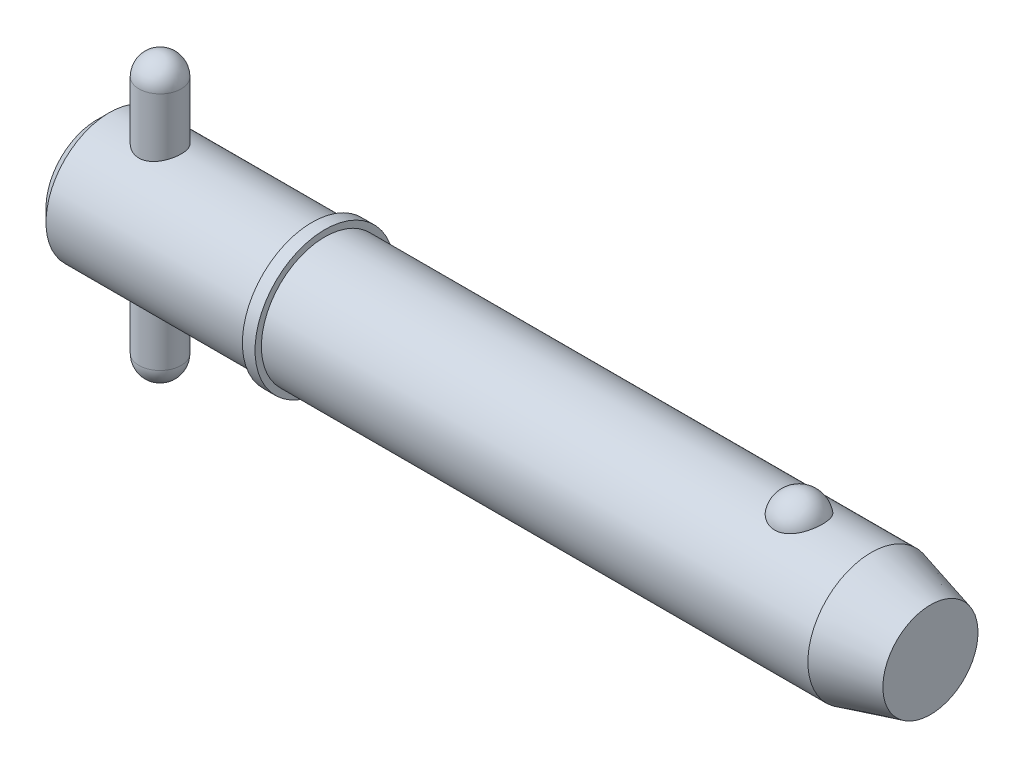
ISO-10303-21;
HEADER;
FILE_DESCRIPTION(('STEP AP214'),'2;1');
FILE_NAME('part.step','',(''),(''),'','','');
FILE_SCHEMA(('AUTOMOTIVE_DESIGN { 1 0 10303 214 1 1 1 1 }'));
ENDSEC;
DATA;
#1=APPLICATION_CONTEXT('core data for automotive mechanical design processes');
#2=APPLICATION_PROTOCOL_DEFINITION('international standard','automotive_design',2000,#1);
#3=PRODUCT_CONTEXT('',#1,'mechanical');
#4=PRODUCT('Part','Part','',(#3));
#5=PRODUCT_RELATED_PRODUCT_CATEGORY('part','',(#4));
#6=PRODUCT_DEFINITION_FORMATION('','',#4);
#7=PRODUCT_DEFINITION_CONTEXT('part definition',#1,'design');
#8=PRODUCT_DEFINITION('design','',#6,#7);
#9=PRODUCT_DEFINITION_SHAPE('','',#8);
#10=(LENGTH_UNIT() NAMED_UNIT(*) SI_UNIT(.MILLI.,.METRE.));
#11=(NAMED_UNIT(*) PLANE_ANGLE_UNIT() SI_UNIT($,.RADIAN.));
#12=(NAMED_UNIT(*) SI_UNIT($,.STERADIAN.) SOLID_ANGLE_UNIT());
#13=UNCERTAINTY_MEASURE_WITH_UNIT(LENGTH_MEASURE(1.E-05),#10,'distance_accuracy_value','');
#14=(GEOMETRIC_REPRESENTATION_CONTEXT(3) GLOBAL_UNCERTAINTY_ASSIGNED_CONTEXT((#13)) GLOBAL_UNIT_ASSIGNED_CONTEXT((#10,
#11,#12)) REPRESENTATION_CONTEXT('',''));
#15=CARTESIAN_POINT('',(0.,0.,0.));
#16=DIRECTION('',(0.,0.,1.));
#17=DIRECTION('',(1.,0.,0.));
#18=AXIS2_PLACEMENT_3D('',#15,#16,#17);
#19=CARTESIAN_POINT('',(7.14,15.875,0.));
#20=DIRECTION('',(0.,-1.,0.));
#21=DIRECTION('',(0.,0.,-1.));
#22=AXIS2_PLACEMENT_3D('',#19,#20,#21);
#23=CYLINDRICAL_SURFACE('',#22,2.38);
#24=CARTESIAN_POINT('',(7.14,-13.495,0.));
#25=DIRECTION('',(0.,-1.,0.));
#26=DIRECTION('',(0.,0.,-1.));
#27=AXIS2_PLACEMENT_3D('',#24,#25,#26);
#28=CIRCLE('',#27,2.38);
#29=CARTESIAN_POINT('',(7.14,-13.495,-2.38));
#30=VERTEX_POINT('',#29);
#31=EDGE_CURVE('P0_E10',#30,#30,#28,.F.);
#32=ORIENTED_EDGE('',*,*,#31,.T.);
#33=EDGE_LOOP('',(#32));
#34=FACE_BOUND('',#33,.T.);
#35=CARTESIAN_POINT('',(7.14,13.495,0.));
#36=DIRECTION('',(0.,-1.,0.));
#37=DIRECTION('',(0.,0.,-1.));
#38=AXIS2_PLACEMENT_3D('',#35,#36,#37);
#39=CIRCLE('',#38,2.38);
#40=CARTESIAN_POINT('',(7.14,13.495,-2.38));
#41=VERTEX_POINT('',#40);
#42=EDGE_CURVE('P0_E21',#41,#41,#39,.T.);
#43=ORIENTED_EDGE('',*,*,#42,.T.);
#44=EDGE_LOOP('',(#43));
#45=FACE_BOUND('',#44,.T.);
#46=ADVANCED_FACE('P0_F14',(#34,#45),#23,.T.);
#47=CARTESIAN_POINT('',(7.14,-13.495,0.));
#48=DIRECTION('',(0.,0.,1.));
#49=DIRECTION('',(1.,0.,0.));
#50=AXIS2_PLACEMENT_3D('',#47,#48,#49);
#51=SPHERICAL_SURFACE('',#50,2.38);
#52=CARTESIAN_POINT('',(7.14,-13.495,0.));
#53=DIRECTION('',(0.,-1.,0.));
#54=DIRECTION('',(0.,0.,-1.));
#55=AXIS2_PLACEMENT_3D('',#52,#53,#54);
#56=SPHERICAL_SURFACE('',#55,2.38);
#57=ORIENTED_EDGE('',*,*,#31,.F.);
#58=EDGE_LOOP('',(#57));
#59=FACE_BOUND('',#58,.T.);
#60=ADVANCED_FACE('P0_F29',(#59),#56,.T.);
#61=CARTESIAN_POINT('',(7.14,13.495,0.));
#62=DIRECTION('',(0.,0.,1.));
#63=DIRECTION('',(1.,0.,0.));
#64=AXIS2_PLACEMENT_3D('',#61,#62,#63);
#65=SPHERICAL_SURFACE('',#64,2.38);
#66=CARTESIAN_POINT('',(7.14,13.495,0.));
#67=DIRECTION('',(0.,-1.,0.));
#68=DIRECTION('',(0.,0.,-1.));
#69=AXIS2_PLACEMENT_3D('',#66,#67,#68);
#70=SPHERICAL_SURFACE('',#69,2.38);
#71=ORIENTED_EDGE('',*,*,#42,.F.);
#72=EDGE_LOOP('',(#71));
#73=FACE_BOUND('',#72,.T.);
#74=ADVANCED_FACE('P0_F16',(#73),#70,.T.);
#75=CLOSED_SHELL('',(#46,#60,#74));
#76=MANIFOLD_SOLID_BREP('P0_B1',#75);
#77=CARTESIAN_POINT('',(0.,0.,0.));
#78=DIRECTION('',(1.,0.,0.));
#79=DIRECTION('',(0.,0.,-1.));
#80=AXIS2_PLACEMENT_3D('',#77,#78,#79);
#81=CYLINDRICAL_SURFACE('',#80,7.145);
#82=CARTESIAN_POINT('',(87.2836242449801,0.,0.));
#83=DIRECTION('',(1.,0.,0.));
#84=DIRECTION('',(0.,0.,-1.));
#85=AXIS2_PLACEMENT_3D('',#82,#83,#84);
#86=CIRCLE('',#85,7.145);
#87=CARTESIAN_POINT('',(87.2836242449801,0.,-7.145));
#88=VERTEX_POINT('',#87);
#89=EDGE_CURVE('P1_E81',#88,#88,#86,.T.);
#90=ORIENTED_EDGE('',*,*,#89,.F.);
#91=EDGE_LOOP('',(#90));
#92=FACE_BOUND('',#91,.T.);
#93=CARTESIAN_POINT('',(25.7,0.,0.));
#94=DIRECTION('',(1.,0.,0.));
#95=DIRECTION('',(0.,0.,-1.));
#96=AXIS2_PLACEMENT_3D('',#93,#94,#95);
#97=CIRCLE('',#96,7.145);
#98=CARTESIAN_POINT('',(25.7,0.,-7.145));
#99=VERTEX_POINT('',#98);
#100=EDGE_CURVE('P1_E85',#99,#99,#97,.T.);
#101=ORIENTED_EDGE('',*,*,#100,.T.);
#102=EDGE_LOOP('',(#101));
#103=FACE_BOUND('',#102,.T.);
#104=CARTESIAN_POINT('',(79.1395037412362,6.60328629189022,2.72903557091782));
#105=CARTESIAN_POINT('',(78.998315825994,6.60329644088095,2.72902496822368));
#106=CARTESIAN_POINT('',(78.8568832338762,6.60799490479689,2.71772840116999));
#107=CARTESIAN_POINT('',(78.5779557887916,6.62628236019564,2.67281935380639));
#108=CARTESIAN_POINT('',(78.4404726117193,6.63989534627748,2.63914664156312));
#109=CARTESIAN_POINT('',(78.1738894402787,6.67440775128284,2.55059642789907));
#110=CARTESIAN_POINT('',(78.0447683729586,6.69528793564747,2.49577486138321));
#111=CARTESIAN_POINT('',(77.7978694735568,6.74205585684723,2.36651799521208));
#112=CARTESIAN_POINT('',(77.6800865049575,6.76794130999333,2.29209163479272));
#113=CARTESIAN_POINT('',(77.4551671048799,6.82286177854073,2.12312937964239));
#114=CARTESIAN_POINT('',(77.3484405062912,6.85196655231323,2.02807107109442));
#115=CARTESIAN_POINT('',(77.1519181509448,6.90970232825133,1.82167822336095));
#116=CARTESIAN_POINT('',(77.0621276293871,6.93833318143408,1.71033867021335));
#117=CARTESIAN_POINT('',(76.8976670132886,6.9935167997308,1.46891951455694));
#118=CARTESIAN_POINT('',(76.823844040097,7.01992110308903,1.33822781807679));
#119=CARTESIAN_POINT('',(76.6980884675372,7.06643385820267,1.0656656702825));
#120=CARTESIAN_POINT('',(76.6461573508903,7.08654188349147,0.923794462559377));
#121=CARTESIAN_POINT('',(76.5647323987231,7.11862399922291,0.630993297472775));
#122=CARTESIAN_POINT('',(76.5355167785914,7.13049704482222,0.479974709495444));
#123=CARTESIAN_POINT('',(76.5011742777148,7.14449484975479,0.174782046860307));
#124=CARTESIAN_POINT('',(76.4960466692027,7.14661990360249,0.0206080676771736));
#125=CARTESIAN_POINT('',(76.509938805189,7.14092465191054,-0.285506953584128));
#126=CARTESIAN_POINT('',(76.5288101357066,7.1331654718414,-0.437455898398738));
#127=CARTESIAN_POINT('',(76.5900622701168,7.10859076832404,-0.73577860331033));
#128=CARTESIAN_POINT('',(76.6324435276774,7.0917750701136,-0.882152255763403));
#129=CARTESIAN_POINT('',(76.7399346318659,7.05076716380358,-1.16543149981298));
#130=CARTESIAN_POINT('',(76.8050759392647,7.02656475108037,-1.30232366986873));
#131=CARTESIAN_POINT('',(76.9567597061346,6.97329145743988,-1.56265907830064));
#132=CARTESIAN_POINT('',(77.0433039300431,6.94422017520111,-1.68610120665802));
#133=CARTESIAN_POINT('',(77.2364654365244,6.88415108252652,-1.91671004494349));
#134=CARTESIAN_POINT('',(77.3431807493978,6.85314438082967,-2.02379244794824));
#135=CARTESIAN_POINT('',(77.5739740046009,6.79282069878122,-2.21787433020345));
#136=CARTESIAN_POINT('',(77.6980505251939,6.76350358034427,-2.30487545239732));
#137=CARTESIAN_POINT('',(77.9576784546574,6.7106058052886,-2.45458647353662));
#138=CARTESIAN_POINT('',(78.0929387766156,6.68691885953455,-2.5177624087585));
#139=CARTESIAN_POINT('',(78.3732778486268,6.64741247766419,-2.62030218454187));
#140=CARTESIAN_POINT('',(78.518352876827,6.63159007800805,-2.65967499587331));
#141=CARTESIAN_POINT('',(78.8063475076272,6.61038594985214,-2.71193301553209));
#142=CARTESIAN_POINT('',(78.9490080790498,6.60451880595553,-2.72605165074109));
#143=CARTESIAN_POINT('',(79.2348004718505,6.60240611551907,-2.73116688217));
#144=CARTESIAN_POINT('',(79.3779321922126,6.60615862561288,-2.72216814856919));
#145=CARTESIAN_POINT('',(79.6558486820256,6.6225609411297,-2.68200435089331));
#146=CARTESIAN_POINT('',(79.7907542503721,6.63492533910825,-2.65154998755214));
#147=CARTESIAN_POINT('',(80.05332009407,6.66687445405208,-2.57015684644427));
#148=CARTESIAN_POINT('',(80.1809797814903,6.68645975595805,-2.51921640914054));
#149=CARTESIAN_POINT('',(80.4285777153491,6.73127274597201,-2.39693610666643));
#150=CARTESIAN_POINT('',(80.5482878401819,6.7566138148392,-2.32517694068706));
#151=CARTESIAN_POINT('',(80.7741592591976,6.8100600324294,-2.1636381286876));
#152=CARTESIAN_POINT('',(80.880317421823,6.83816581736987,-2.07385432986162));
#153=CARTESIAN_POINT('',(81.0818620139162,6.89580469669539,-1.87357235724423));
#154=CARTESIAN_POINT('',(81.176440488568,6.92533863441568,-1.76226074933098));
#155=CARTESIAN_POINT('',(81.3463329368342,6.98139526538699,-1.52511696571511));
#156=CARTESIAN_POINT('',(81.4216434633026,7.0079174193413,-1.39928219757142));
#157=CARTESIAN_POINT('',(81.553595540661,7.05607625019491,-1.1321597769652));
#158=CARTESIAN_POINT('',(81.6095688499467,7.07753119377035,-0.990508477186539));
#159=CARTESIAN_POINT('',(81.6982965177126,7.11222355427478,-0.699154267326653));
#160=CARTESIAN_POINT('',(81.7310506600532,7.12546089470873,-0.549451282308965));
#161=CARTESIAN_POINT('',(81.7726899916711,7.1423758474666,-0.246120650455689));
#162=CARTESIAN_POINT('',(81.781558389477,7.14604673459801,-0.0924903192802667));
#163=CARTESIAN_POINT('',(81.7751940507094,7.14343510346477,0.214181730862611));
#164=CARTESIAN_POINT('',(81.7599618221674,7.13715279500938,0.367223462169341));
#165=CARTESIAN_POINT('',(81.7058451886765,7.11532948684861,0.667595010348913));
#166=CARTESIAN_POINT('',(81.6670776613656,7.09983424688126,0.814949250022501));
#167=CARTESIAN_POINT('',(81.5667700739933,7.06119140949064,1.10063221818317));
#168=CARTESIAN_POINT('',(81.5052284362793,7.03804328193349,1.23896032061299));
#169=CARTESIAN_POINT('',(81.3602071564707,6.98632429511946,1.5035230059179));
#170=CARTESIAN_POINT('',(81.2766067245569,6.95772382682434,1.62968561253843));
#171=CARTESIAN_POINT('',(81.0893804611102,6.89823072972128,1.865543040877));
#172=CARTESIAN_POINT('',(80.9857557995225,6.86733823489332,1.9752388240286));
#173=CARTESIAN_POINT('',(80.7610769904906,6.80676456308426,2.17482293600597));
#174=CARTESIAN_POINT('',(80.6400673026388,6.77708053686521,2.26476035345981));
#175=CARTESIAN_POINT('',(80.3833408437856,6.7223050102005,2.42252989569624));
#176=CARTESIAN_POINT('',(80.2476185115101,6.69721525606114,2.49035362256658));
#177=CARTESIAN_POINT('',(79.9704022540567,6.65552591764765,2.59967646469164));
#178=CARTESIAN_POINT('',(79.8292810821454,6.63865794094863,2.64202017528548));
#179=CARTESIAN_POINT('',(79.5414448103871,6.61425039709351,2.70255841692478));
#180=CARTESIAN_POINT('',(79.3947480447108,6.60668259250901,2.720826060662));
#181=CARTESIAN_POINT('',(79.2116799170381,6.60358754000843,2.72830331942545));
#182=CARTESIAN_POINT('',(79.1755998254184,6.60328369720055,2.72903828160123));
#183=CARTESIAN_POINT('',(79.1395037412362,6.60328629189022,2.72903557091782));
#184=B_SPLINE_CURVE_WITH_KNOTS('',3,(#104,#105,#106,#107,#108,#109,#110,#111,#112,#113,#114,
#115,#116,#117,#118,#119,#120,#121,#122,#123,#124,#125,#126,#127,#128,#129,#130,#131,#132,#133,
#134,#135,#136,#137,#138,#139,#140,#141,#142,#143,#144,#145,#146,#147,#148,#149,#150,#151,#152,
#153,#154,#155,#156,#157,#158,#159,#160,#161,#162,#163,#164,#165,#166,#167,#168,#169,#170,#171,
#172,#173,#174,#175,#176,#177,#178,#179,#180,#181,#182,#183),.UNSPECIFIED.,.T.,.F.,(4,2,2,2,2,2,
2,2,2,2,2,2,2,2,2,2,2,2,2,2,2,2,2,2,2,2,2,2,2,2,2,2,2,2,2,2,2,2,2,4),(0.,0.423468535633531,
0.848081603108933,1.27157926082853,1.69488414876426,2.13051395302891,2.56627819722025,
3.0213670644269,3.47648674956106,3.93709649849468,4.39769233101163,4.85545355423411,
5.31322361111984,5.77162895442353,6.23007210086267,6.69080337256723,7.15149693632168,
7.60264329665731,8.05361952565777,8.48189729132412,8.91008854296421,9.32472524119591,
9.73939553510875,10.1630783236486,10.5868588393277,11.0319070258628,11.4770347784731,
11.9362874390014,12.3955443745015,12.855124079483,13.3146940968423,13.7720003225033,
14.2293382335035,14.6892343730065,15.1491036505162,15.6078171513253,16.0667046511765,
16.5093965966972,16.9507410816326,17.059004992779),.UNSPECIFIED.);
#185=CARTESIAN_POINT('',(79.1395037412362,6.60328629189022,2.72903557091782));
#186=VERTEX_POINT('',#185);
#187=EDGE_CURVE('P1_E35',#186,#186,#184,.T.);
#188=ORIENTED_EDGE('',*,*,#187,.T.);
#189=EDGE_LOOP('',(#188));
#190=FACE_BOUND('',#189,.T.);
#191=ADVANCED_FACE('P1_F13',(#92,#103,#190),#81,.T.);
#192=CARTESIAN_POINT('',(0.,0.,0.));
#193=DIRECTION('',(-1.,0.,0.));
#194=DIRECTION('',(0.,0.,1.));
#195=AXIS2_PLACEMENT_3D('',#192,#193,#194);
#196=PLANE('',#195);
#197=CARTESIAN_POINT('',(0.,0.,0.));
#198=DIRECTION('',(1.,0.,0.));
#199=DIRECTION('',(0.,0.,-1.));
#200=AXIS2_PLACEMENT_3D('',#197,#198,#199);
#201=CIRCLE('',#200,5.716);
#202=CARTESIAN_POINT('',(0.,0.,-5.716));
#203=VERTEX_POINT('',#202);
#204=EDGE_CURVE('P1_E9',#203,#203,#201,.T.);
#205=ORIENTED_EDGE('',*,*,#204,.F.);
#206=EDGE_LOOP('',(#205));
#207=FACE_BOUND('',#206,.T.);
#208=ADVANCED_FACE('P1_F15',(#207),#196,.T.);
#209=CARTESIAN_POINT('',(1.42899999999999,0.,0.));
#210=DIRECTION('',(1.,0.,0.));
#211=DIRECTION('',(0.,0.,-1.));
#212=AXIS2_PLACEMENT_3D('',#209,#210,#211);
#213=CONICAL_SURFACE('',#212,7.145,0.78539816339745);
#214=ORIENTED_EDGE('',*,*,#204,.T.);
#215=EDGE_LOOP('',(#214));
#216=FACE_BOUND('',#215,.T.);
#217=CARTESIAN_POINT('',(1.42899999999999,0.,0.));
#218=DIRECTION('',(1.,0.,0.));
#219=DIRECTION('',(0.,0.,-1.));
#220=AXIS2_PLACEMENT_3D('',#217,#218,#219);
#221=CIRCLE('',#220,7.145);
#222=CARTESIAN_POINT('',(1.42899999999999,0.,-7.145));
#223=VERTEX_POINT('',#222);
#224=EDGE_CURVE('P1_E26',#223,#223,#221,.T.);
#225=ORIENTED_EDGE('',*,*,#224,.F.);
#226=EDGE_LOOP('',(#225));
#227=FACE_BOUND('',#226,.T.);
#228=ADVANCED_FACE('P1_F77',(#216,#227),#213,.T.);
#229=CARTESIAN_POINT('',(0.,0.,0.));
#230=DIRECTION('',(1.,0.,0.));
#231=DIRECTION('',(0.,0.,-1.));
#232=AXIS2_PLACEMENT_3D('',#229,#230,#231);
#233=CYLINDRICAL_SURFACE('',#232,7.145);
#234=CARTESIAN_POINT('',(7.14,-6.73695962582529,2.38));
#235=CARTESIAN_POINT('',(7.01035997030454,-6.73695921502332,2.38000059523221));
#236=CARTESIAN_POINT('',(6.88072348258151,-6.74074253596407,2.36937183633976));
#237=CARTESIAN_POINT('',(6.62529075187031,-6.75538853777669,2.32728080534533));
#238=CARTESIAN_POINT('',(6.49949514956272,-6.76625239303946,2.29581507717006));
#239=CARTESIAN_POINT('',(6.2554858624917,-6.79369535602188,2.21327763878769));
#240=CARTESIAN_POINT('',(6.13725786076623,-6.81026326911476,2.16224430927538));
#241=CARTESIAN_POINT('',(5.91100349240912,-6.84723128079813,2.04215132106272));
#242=CARTESIAN_POINT('',(5.80297937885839,-6.86763222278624,1.97308769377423));
#243=CARTESIAN_POINT('',(5.59597854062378,-6.91086152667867,1.81600414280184));
#244=CARTESIAN_POINT('',(5.49745861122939,-6.93375032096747,1.72739874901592));
#245=CARTESIAN_POINT('',(5.31636508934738,-6.97886546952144,1.53499636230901));
#246=CARTESIAN_POINT('',(5.23379405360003,-7.00109171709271,1.43119693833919));
#247=CARTESIAN_POINT('',(5.08487013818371,-7.04307708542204,1.20801318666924));
#248=CARTESIAN_POINT('',(5.01899578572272,-7.06275685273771,1.08829330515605));
#249=CARTESIAN_POINT('',(4.90850130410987,-7.09671988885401,0.838703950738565));
#250=CARTESIAN_POINT('',(4.86387545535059,-7.11100460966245,0.70883722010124));
#251=CARTESIAN_POINT('',(4.79869354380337,-7.13213998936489,0.44742990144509));
#252=CARTESIAN_POINT('',(4.77735497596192,-7.13923172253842,0.316104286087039));
#253=CARTESIAN_POINT('',(4.75686536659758,-7.14603777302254,0.0515578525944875));
#254=CARTESIAN_POINT('',(4.75770861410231,-7.14575398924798,-0.0816624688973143));
#255=CARTESIAN_POINT('',(4.78106216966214,-7.13800438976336,-0.340678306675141));
#256=CARTESIAN_POINT('',(4.80272255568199,-7.13082030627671,-0.466560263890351));
#257=CARTESIAN_POINT('',(4.86569013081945,-7.11043095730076,-0.712788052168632));
#258=CARTESIAN_POINT('',(4.90699865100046,-7.09722528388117,-0.833133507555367));
#259=CARTESIAN_POINT('',(5.00858673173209,-7.06591754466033,-1.06673173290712));
#260=CARTESIAN_POINT('',(5.06910834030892,-7.0477534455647,-1.17987058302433));
#261=CARTESIAN_POINT('',(5.20720514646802,-7.00841977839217,-1.39463797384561));
#262=CARTESIAN_POINT('',(5.28478508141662,-6.987249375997,-1.49626330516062));
#263=CARTESIAN_POINT('',(5.4590800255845,-6.94296010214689,-1.69017445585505));
#264=CARTESIAN_POINT('',(5.55652324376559,-6.91979641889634,-1.78179645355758));
#265=CARTESIAN_POINT('',(5.76558873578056,-6.87497076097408,-1.94761348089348));
#266=CARTESIAN_POINT('',(5.87721318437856,-6.85330901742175,-2.02180583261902));
#267=CARTESIAN_POINT('',(6.11357367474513,-6.81369485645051,-2.15157488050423));
#268=CARTESIAN_POINT('',(6.23847358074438,-6.79579956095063,-2.20687188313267));
#269=CARTESIAN_POINT('',(6.49655785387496,-6.76640630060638,-2.29542443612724));
#270=CARTESIAN_POINT('',(6.62973872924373,-6.75490565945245,-2.32868920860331));
#271=CARTESIAN_POINT('',(6.89417536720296,-6.74020933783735,-2.37088225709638));
#272=CARTESIAN_POINT('',(7.02524746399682,-6.73666278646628,-2.38083959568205));
#273=CARTESIAN_POINT('',(7.28721035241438,-6.73729555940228,-2.37904974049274));
#274=CARTESIAN_POINT('',(7.41810117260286,-6.7414734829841,-2.36730648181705));
#275=CARTESIAN_POINT('',(7.67130717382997,-6.75673471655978,-2.32337336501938));
#276=CARTESIAN_POINT('',(7.79376251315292,-6.76757635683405,-2.29189834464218));
#277=CARTESIAN_POINT('',(8.03162917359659,-6.79467771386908,-2.21025275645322));
#278=CARTESIAN_POINT('',(8.14703924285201,-6.8109383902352,-2.16007887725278));
#279=CARTESIAN_POINT('',(8.37159169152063,-6.84768362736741,-2.04065289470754));
#280=CARTESIAN_POINT('',(8.48041962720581,-6.86828569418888,-1.97084668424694));
#281=CARTESIAN_POINT('',(8.68518919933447,-6.91116416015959,-1.8147657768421));
#282=CARTESIAN_POINT('',(8.78112702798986,-6.93344105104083,-1.72848623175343));
#283=CARTESIAN_POINT('',(8.96215574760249,-6.97845348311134,-1.53698616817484));
#284=CARTESIAN_POINT('',(9.04650427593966,-7.00115965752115,-1.43105491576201));
#285=CARTESIAN_POINT('',(9.19627592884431,-7.04341676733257,-1.20598377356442));
#286=CARTESIAN_POINT('',(9.26169972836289,-7.06296781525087,-1.08684435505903));
#287=CARTESIAN_POINT('',(9.37116617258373,-7.0966205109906,-0.83933303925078));
#288=CARTESIAN_POINT('',(9.41534821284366,-7.11075755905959,-0.711027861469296));
#289=CARTESIAN_POINT('',(9.48132660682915,-7.13214194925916,-0.448245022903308));
#290=CARTESIAN_POINT('',(9.50313102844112,-7.13939177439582,-0.313769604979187));
#291=CARTESIAN_POINT('',(9.5230098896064,-7.14599771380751,-0.049254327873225));
#292=CARTESIAN_POINT('',(9.52215013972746,-7.14570837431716,0.0806974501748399));
#293=CARTESIAN_POINT('',(9.49935359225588,-7.13814116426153,0.338518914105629));
#294=CARTESIAN_POINT('',(9.47741850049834,-7.13086385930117,0.466388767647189));
#295=CARTESIAN_POINT('',(9.4138005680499,-7.11026814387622,0.714400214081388));
#296=CARTESIAN_POINT('',(9.37243609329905,-7.09704726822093,0.834632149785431));
#297=CARTESIAN_POINT('',(9.27142829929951,-7.06592602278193,1.06649582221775));
#298=CARTESIAN_POINT('',(9.2117816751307,-7.04802480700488,1.1781259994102));
#299=CARTESIAN_POINT('',(9.07336776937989,-7.00856499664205,1.39411030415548));
#300=CARTESIAN_POINT('',(8.99397590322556,-6.98689577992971,1.49804368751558));
#301=CARTESIAN_POINT('',(8.81938810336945,-6.9426110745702,1.69146078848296));
#302=CARTESIAN_POINT('',(8.72418713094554,-6.91999528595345,1.78093988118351));
#303=CARTESIAN_POINT('',(8.51623540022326,-6.87531507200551,1.94646188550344));
#304=CARTESIAN_POINT('',(8.4029442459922,-6.85330672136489,2.02184316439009));
#305=CARTESIAN_POINT('',(8.16461714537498,-6.81342065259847,2.1524427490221));
#306=CARTESIAN_POINT('',(8.03958429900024,-6.7955418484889,2.20766635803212));
#307=CARTESIAN_POINT('',(7.78712566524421,-6.76686117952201,2.29403636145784));
#308=CARTESIAN_POINT('',(7.66006989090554,-6.75577342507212,2.32616709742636));
#309=CARTESIAN_POINT('',(7.40200728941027,-6.74082409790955,2.36914495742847));
#310=CARTESIAN_POINT('',(7.27100183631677,-6.73696004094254,2.37999939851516));
#311=CARTESIAN_POINT('',(7.14,-6.73695962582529,2.38));
#312=B_SPLINE_CURVE_WITH_KNOTS('',3,(#234,#235,#236,#237,#238,#239,#240,#241,#242,#243,#244,
#245,#246,#247,#248,#249,#250,#251,#252,#253,#254,#255,#256,#257,#258,#259,#260,#261,#262,#263,
#264,#265,#266,#267,#268,#269,#270,#271,#272,#273,#274,#275,#276,#277,#278,#279,#280,#281,#282,
#283,#284,#285,#286,#287,#288,#289,#290,#291,#292,#293,#294,#295,#296,#297,#298,#299,#300,#301,
#302,#303,#304,#305,#306,#307,#308,#309,#310,#311),.UNSPECIFIED.,.T.,.F.,(4,2,2,2,2,2,2,2,2,2,2,
2,2,2,2,2,2,2,2,2,2,2,2,2,2,2,2,2,2,2,2,2,2,2,2,2,2,2,4),(0.,0.388434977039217,
0.776934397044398,1.16467566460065,1.55250234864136,1.9540847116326,2.35573139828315,
2.76784120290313,3.17984001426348,3.57752248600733,3.97510257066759,4.35711073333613,
4.7391447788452,5.12619663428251,5.51335611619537,5.91871976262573,6.3241456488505,
6.73533623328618,7.14635459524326,7.53885245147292,7.93127914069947,8.31025106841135,
8.68929014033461,9.08033871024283,9.47150254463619,9.88145528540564,10.2913934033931,
10.6986033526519,11.1056664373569,11.4936225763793,11.8815473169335,12.2633262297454,
12.645174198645,13.0411187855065,13.437189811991,13.8487371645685,14.2601761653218,
14.6528265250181,15.0453418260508),.UNSPECIFIED.);
#313=CARTESIAN_POINT('',(7.14,-6.73695962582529,2.38));
#314=VERTEX_POINT('',#313);
#315=EDGE_CURVE('P1_E17',#314,#314,#312,.T.);
#316=ORIENTED_EDGE('',*,*,#315,.F.);
#317=EDGE_LOOP('',(#316));
#318=FACE_BOUND('',#317,.T.);
#319=CARTESIAN_POINT('',(7.14,6.73695962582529,2.38));
#320=CARTESIAN_POINT('',(7.26964002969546,6.73695921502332,2.38000059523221));
#321=CARTESIAN_POINT('',(7.39927651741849,6.74074253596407,2.36937183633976));
#322=CARTESIAN_POINT('',(7.65470924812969,6.75538853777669,2.32728080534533));
#323=CARTESIAN_POINT('',(7.78050485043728,6.76625239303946,2.29581507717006));
#324=CARTESIAN_POINT('',(8.02451413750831,6.79369535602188,2.21327763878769));
#325=CARTESIAN_POINT('',(8.14274213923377,6.81026326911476,2.16224430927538));
#326=CARTESIAN_POINT('',(8.36899650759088,6.84723128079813,2.04215132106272));
#327=CARTESIAN_POINT('',(8.47702062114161,6.86763222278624,1.97308769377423));
#328=CARTESIAN_POINT('',(8.68402145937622,6.91086152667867,1.81600414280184));
#329=CARTESIAN_POINT('',(8.78254138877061,6.93375032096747,1.72739874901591));
#330=CARTESIAN_POINT('',(8.96363491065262,6.97886546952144,1.53499636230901));
#331=CARTESIAN_POINT('',(9.04620594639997,7.00109171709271,1.43119693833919));
#332=CARTESIAN_POINT('',(9.19512986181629,7.04307708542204,1.20801318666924));
#333=CARTESIAN_POINT('',(9.26100421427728,7.06275685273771,1.08829330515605));
#334=CARTESIAN_POINT('',(9.37149869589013,7.09671988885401,0.838703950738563));
#335=CARTESIAN_POINT('',(9.41612454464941,7.11100460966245,0.708837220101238));
#336=CARTESIAN_POINT('',(9.48130645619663,7.13213998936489,0.447429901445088));
#337=CARTESIAN_POINT('',(9.50264502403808,7.13923172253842,0.316104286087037));
#338=CARTESIAN_POINT('',(9.52313463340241,7.14603777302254,0.0515578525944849));
#339=CARTESIAN_POINT('',(9.52229138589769,7.14575398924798,-0.0816624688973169));
#340=CARTESIAN_POINT('',(9.49893783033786,7.13800438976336,-0.340678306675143));
#341=CARTESIAN_POINT('',(9.47727744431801,7.13082030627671,-0.466560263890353));
#342=CARTESIAN_POINT('',(9.41430986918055,7.11043095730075,-0.712788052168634));
#343=CARTESIAN_POINT('',(9.37300134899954,7.09722528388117,-0.833133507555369));
#344=CARTESIAN_POINT('',(9.27141326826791,7.06591754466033,-1.06673173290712));
#345=CARTESIAN_POINT('',(9.21089165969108,7.0477534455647,-1.17987058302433));
#346=CARTESIAN_POINT('',(9.07279485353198,7.00841977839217,-1.39463797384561));
#347=CARTESIAN_POINT('',(8.99521491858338,6.987249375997,-1.49626330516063));
#348=CARTESIAN_POINT('',(8.82091997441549,6.94296010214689,-1.69017445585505));
#349=CARTESIAN_POINT('',(8.72347675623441,6.91979641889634,-1.78179645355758));
#350=CARTESIAN_POINT('',(8.51441126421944,6.87497076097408,-1.94761348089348));
#351=CARTESIAN_POINT('',(8.40278681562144,6.85330901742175,-2.02180583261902));
#352=CARTESIAN_POINT('',(8.16642632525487,6.81369485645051,-2.15157488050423));
#353=CARTESIAN_POINT('',(8.04152641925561,6.79579956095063,-2.20687188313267));
#354=CARTESIAN_POINT('',(7.78344214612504,6.76640630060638,-2.29542443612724));
#355=CARTESIAN_POINT('',(7.65026127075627,6.75490565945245,-2.32868920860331));
#356=CARTESIAN_POINT('',(7.38582463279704,6.74020933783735,-2.37088225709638));
#357=CARTESIAN_POINT('',(7.25475253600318,6.73666278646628,-2.38083959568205));
#358=CARTESIAN_POINT('',(6.99278964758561,6.73729555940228,-2.37904974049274));
#359=CARTESIAN_POINT('',(6.86189882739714,6.7414734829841,-2.36730648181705));
#360=CARTESIAN_POINT('',(6.60869282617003,6.75673471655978,-2.32337336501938));
#361=CARTESIAN_POINT('',(6.48623748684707,6.76757635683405,-2.29189834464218));
#362=CARTESIAN_POINT('',(6.2483708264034,6.79467771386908,-2.21025275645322));
#363=CARTESIAN_POINT('',(6.13296075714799,6.8109383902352,-2.16007887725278));
#364=CARTESIAN_POINT('',(5.90840830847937,6.84768362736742,-2.04065289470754));
#365=CARTESIAN_POINT('',(5.79958037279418,6.86828569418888,-1.97084668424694));
#366=CARTESIAN_POINT('',(5.59481080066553,6.91116416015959,-1.8147657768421));
#367=CARTESIAN_POINT('',(5.49887297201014,6.93344105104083,-1.72848623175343));
#368=CARTESIAN_POINT('',(5.31784425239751,6.97845348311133,-1.53698616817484));
#369=CARTESIAN_POINT('',(5.23349572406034,7.00115965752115,-1.43105491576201));
#370=CARTESIAN_POINT('',(5.08372407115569,7.04341676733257,-1.20598377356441));
#371=CARTESIAN_POINT('',(5.01830027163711,7.06296781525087,-1.08684435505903));
#372=CARTESIAN_POINT('',(4.90883382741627,7.0966205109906,-0.839333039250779));
#373=CARTESIAN_POINT('',(4.86465178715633,7.11075755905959,-0.711027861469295));
#374=CARTESIAN_POINT('',(4.79867339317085,7.13214194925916,-0.448245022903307));
#375=CARTESIAN_POINT('',(4.77686897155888,7.13939177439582,-0.313769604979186));
#376=CARTESIAN_POINT('',(4.7569901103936,7.14599771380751,-0.0492543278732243));
#377=CARTESIAN_POINT('',(4.75784986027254,7.14570837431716,0.0806974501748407));
#378=CARTESIAN_POINT('',(4.78064640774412,7.13814116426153,0.33851891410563));
#379=CARTESIAN_POINT('',(4.80258149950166,7.13086385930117,0.46638876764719));
#380=CARTESIAN_POINT('',(4.8661994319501,7.11026814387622,0.714400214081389));
#381=CARTESIAN_POINT('',(4.90756390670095,7.09704726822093,0.834632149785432));
#382=CARTESIAN_POINT('',(5.00857170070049,7.06592602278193,1.06649582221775));
#383=CARTESIAN_POINT('',(5.0682183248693,7.04802480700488,1.1781259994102));
#384=CARTESIAN_POINT('',(5.20663223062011,7.00856499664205,1.39411030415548));
#385=CARTESIAN_POINT('',(5.28602409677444,6.98689577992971,1.49804368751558));
#386=CARTESIAN_POINT('',(5.46061189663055,6.9426110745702,1.69146078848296));
#387=CARTESIAN_POINT('',(5.55581286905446,6.91999528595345,1.78093988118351));
#388=CARTESIAN_POINT('',(5.76376459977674,6.87531507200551,1.94646188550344));
#389=CARTESIAN_POINT('',(5.8770557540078,6.85330672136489,2.02184316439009));
#390=CARTESIAN_POINT('',(6.11538285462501,6.81342065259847,2.1524427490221));
#391=CARTESIAN_POINT('',(6.24041570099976,6.7955418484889,2.20766635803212));
#392=CARTESIAN_POINT('',(6.4928743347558,6.76686117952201,2.29403636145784));
#393=CARTESIAN_POINT('',(6.61993010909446,6.75577342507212,2.32616709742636));
#394=CARTESIAN_POINT('',(6.87799271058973,6.74082409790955,2.36914495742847));
#395=CARTESIAN_POINT('',(7.00899816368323,6.73696004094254,2.37999939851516));
#396=CARTESIAN_POINT('',(7.14,6.73695962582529,2.38));
#397=B_SPLINE_CURVE_WITH_KNOTS('',3,(#319,#320,#321,#322,#323,#324,#325,#326,#327,#328,#329,
#330,#331,#332,#333,#334,#335,#336,#337,#338,#339,#340,#341,#342,#343,#344,#345,#346,#347,#348,
#349,#350,#351,#352,#353,#354,#355,#356,#357,#358,#359,#360,#361,#362,#363,#364,#365,#366,#367,
#368,#369,#370,#371,#372,#373,#374,#375,#376,#377,#378,#379,#380,#381,#382,#383,#384,#385,#386,
#387,#388,#389,#390,#391,#392,#393,#394,#395,#396),.UNSPECIFIED.,.T.,.F.,(4,2,2,2,2,2,2,2,2,2,2,
2,2,2,2,2,2,2,2,2,2,2,2,2,2,2,2,2,2,2,2,2,2,2,2,2,2,2,4),(0.,0.388434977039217,
0.776934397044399,1.16467566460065,1.55250234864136,1.9540847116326,2.35573139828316,
2.76784120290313,3.17984001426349,3.57752248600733,3.97510257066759,4.35711073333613,
4.73914477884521,5.12619663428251,5.51335611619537,5.91871976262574,6.3241456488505,
6.73533623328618,7.14635459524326,7.53885245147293,7.93127914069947,8.31025106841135,
8.68929014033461,9.08033871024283,9.47150254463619,9.88145528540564,10.2913934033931,
10.6986033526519,11.1056664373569,11.4936225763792,11.8815473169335,12.2633262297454,
12.645174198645,13.0411187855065,13.437189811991,13.8487371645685,14.2601761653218,
14.6528265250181,15.0453418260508),.UNSPECIFIED.);
#398=CARTESIAN_POINT('',(7.14,6.73695962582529,2.38));
#399=VERTEX_POINT('',#398);
#400=EDGE_CURVE('P1_E43',#399,#399,#397,.T.);
#401=ORIENTED_EDGE('',*,*,#400,.F.);
#402=EDGE_LOOP('',(#401));
#403=FACE_BOUND('',#402,.T.);
#404=ORIENTED_EDGE('',*,*,#224,.T.);
#405=EDGE_LOOP('',(#404));
#406=FACE_BOUND('',#405,.T.);
#407=CARTESIAN_POINT('',(24.271,0.,0.));
#408=DIRECTION('',(1.,0.,0.));
#409=DIRECTION('',(0.,0.,-1.));
#410=AXIS2_PLACEMENT_3D('',#407,#408,#409);
#411=CIRCLE('',#410,7.145);
#412=CARTESIAN_POINT('',(24.271,0.,-7.145));
#413=VERTEX_POINT('',#412);
#414=EDGE_CURVE('P1_E31',#413,#413,#411,.T.);
#415=ORIENTED_EDGE('',*,*,#414,.F.);
#416=EDGE_LOOP('',(#415));
#417=FACE_BOUND('',#416,.T.);
#418=ADVANCED_FACE('P1_F103',(#318,#403,#406,#417),#233,.T.);
#419=CARTESIAN_POINT('',(24.271,7.145,0.));
#420=DIRECTION('',(-1.,0.,0.));
#421=DIRECTION('',(0.,0.,1.));
#422=AXIS2_PLACEMENT_3D('',#419,#420,#421);
#423=PLANE('',#422);
#424=ORIENTED_EDGE('',*,*,#414,.T.);
#425=EDGE_LOOP('',(#424));
#426=FACE_BOUND('',#425,.T.);
#427=CARTESIAN_POINT('',(24.271,0.,0.));
#428=DIRECTION('',(1.,0.,0.));
#429=DIRECTION('',(0.,0.,-1.));
#430=AXIS2_PLACEMENT_3D('',#427,#428,#429);
#431=CIRCLE('',#430,7.8595);
#432=CARTESIAN_POINT('',(24.271,0.,-7.8595));
#433=VERTEX_POINT('',#432);
#434=EDGE_CURVE('P1_E91',#433,#433,#431,.T.);
#435=ORIENTED_EDGE('',*,*,#434,.F.);
#436=EDGE_LOOP('',(#435));
#437=FACE_BOUND('',#436,.T.);
#438=ADVANCED_FACE('P1_F100',(#426,#437),#423,.T.);
#439=CARTESIAN_POINT('',(0.,0.,0.));
#440=DIRECTION('',(1.,0.,0.));
#441=DIRECTION('',(0.,0.,-1.));
#442=AXIS2_PLACEMENT_3D('',#439,#440,#441);
#443=CYLINDRICAL_SURFACE('',#442,7.8595);
#444=ORIENTED_EDGE('',*,*,#434,.T.);
#445=EDGE_LOOP('',(#444));
#446=FACE_BOUND('',#445,.T.);
#447=CARTESIAN_POINT('',(25.7,0.,0.));
#448=DIRECTION('',(1.,0.,0.));
#449=DIRECTION('',(0.,0.,-1.));
#450=AXIS2_PLACEMENT_3D('',#447,#448,#449);
#451=CIRCLE('',#450,7.8595);
#452=CARTESIAN_POINT('',(25.7,0.,-7.8595));
#453=VERTEX_POINT('',#452);
#454=EDGE_CURVE('P1_E88',#453,#453,#451,.T.);
#455=ORIENTED_EDGE('',*,*,#454,.F.);
#456=EDGE_LOOP('',(#455));
#457=FACE_BOUND('',#456,.T.);
#458=ADVANCED_FACE('P1_F68',(#446,#457),#443,.T.);
#459=CARTESIAN_POINT('',(25.7,7.8595,0.));
#460=DIRECTION('',(1.,0.,0.));
#461=DIRECTION('',(0.,0.,-1.));
#462=AXIS2_PLACEMENT_3D('',#459,#460,#461);
#463=PLANE('',#462);
#464=ORIENTED_EDGE('',*,*,#454,.T.);
#465=EDGE_LOOP('',(#464));
#466=FACE_BOUND('',#465,.T.);
#467=ORIENTED_EDGE('',*,*,#100,.F.);
#468=EDGE_LOOP('',(#467));
#469=FACE_BOUND('',#468,.T.);
#470=ADVANCED_FACE('P1_F62',(#466,#469),#463,.T.);
#471=CARTESIAN_POINT('',(93.95,0.,0.));
#472=DIRECTION('',(-1.,0.,0.));
#473=DIRECTION('',(0.,0.,1.));
#474=AXIS2_PLACEMENT_3D('',#471,#472,#473);
#475=CONICAL_SURFACE('',#474,5.35875000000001,0.26179938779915);
#476=ORIENTED_EDGE('',*,*,#89,.T.);
#477=EDGE_LOOP('',(#476));
#478=FACE_BOUND('',#477,.T.);
#479=CARTESIAN_POINT('',(93.95,0.,0.));
#480=DIRECTION('',(1.,0.,0.));
#481=DIRECTION('',(0.,0.,-1.));
#482=AXIS2_PLACEMENT_3D('',#479,#480,#481);
#483=CIRCLE('',#482,5.35875000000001);
#484=CARTESIAN_POINT('',(93.95,0.,-5.35875000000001));
#485=VERTEX_POINT('',#484);
#486=EDGE_CURVE('P1_E42',#485,#485,#483,.T.);
#487=ORIENTED_EDGE('',*,*,#486,.F.);
#488=EDGE_LOOP('',(#487));
#489=FACE_BOUND('',#488,.T.);
#490=ADVANCED_FACE('P1_F59',(#478,#489),#475,.T.);
#491=CARTESIAN_POINT('',(93.95,5.35875000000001,0.));
#492=DIRECTION('',(1.,0.,0.));
#493=DIRECTION('',(0.,0.,-1.));
#494=AXIS2_PLACEMENT_3D('',#491,#492,#493);
#495=PLANE('',#494);
#496=ORIENTED_EDGE('',*,*,#486,.T.);
#497=EDGE_LOOP('',(#496));
#498=FACE_BOUND('',#497,.T.);
#499=ADVANCED_FACE('P1_F55',(#498),#495,.T.);
#500=CARTESIAN_POINT('',(79.1395037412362,6.4305,0.));
#501=DIRECTION('',(-1.,0.,0.));
#502=DIRECTION('',(0.,-1.,0.));
#503=AXIS2_PLACEMENT_3D('',#500,#501,#502);
#504=SPHERICAL_SURFACE('',#503,2.73449999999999);
#505=ORIENTED_EDGE('',*,*,#187,.F.);
#506=EDGE_LOOP('',(#505));
#507=FACE_BOUND('',#506,.T.);
#508=ADVANCED_FACE('P1_F50',(#507),#504,.T.);
#509=CARTESIAN_POINT('',(7.14,-7.8595,0.));
#510=DIRECTION('',(0.,1.,0.));
#511=DIRECTION('',(0.,0.,1.));
#512=AXIS2_PLACEMENT_3D('',#509,#510,#511);
#513=CYLINDRICAL_SURFACE('',#512,2.38);
#514=ORIENTED_EDGE('',*,*,#315,.T.);
#515=EDGE_LOOP('',(#514));
#516=FACE_BOUND('',#515,.T.);
#517=ORIENTED_EDGE('',*,*,#400,.T.);
#518=EDGE_LOOP('',(#517));
#519=FACE_BOUND('',#518,.T.);
#520=ADVANCED_FACE('P1_F54',(#516,#519),#513,.F.);
#521=CLOSED_SHELL('',(#191,#208,#228,#418,#438,#458,#470,#490,#499,#508,#520));
#522=MANIFOLD_SOLID_BREP('P1_B1',#521);
#523=ADVANCED_BREP_SHAPE_REPRESENTATION('',(#18,#76,#522),#14);
#524=SHAPE_DEFINITION_REPRESENTATION(#9,#523);
ENDSEC;
END-ISO-10303-21;
